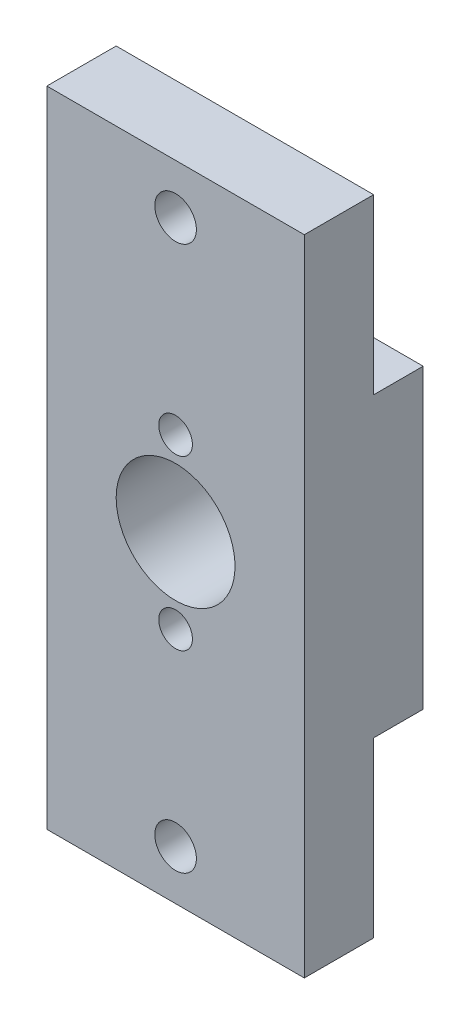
ISO-10303-21;
HEADER;
FILE_DESCRIPTION(('STEP AP214'),'2;1');
FILE_NAME('part.step','',(''),(''),'','','');
FILE_SCHEMA(('AUTOMOTIVE_DESIGN { 1 0 10303 214 1 1 1 1 }'));
ENDSEC;
DATA;
#1=APPLICATION_CONTEXT('core data for automotive mechanical design processes');
#2=APPLICATION_PROTOCOL_DEFINITION('international standard','automotive_design',2000,#1);
#3=PRODUCT_CONTEXT('',#1,'mechanical');
#4=PRODUCT('Part','Part','',(#3));
#5=PRODUCT_RELATED_PRODUCT_CATEGORY('part','',(#4));
#6=PRODUCT_DEFINITION_FORMATION('','',#4);
#7=PRODUCT_DEFINITION_CONTEXT('part definition',#1,'design');
#8=PRODUCT_DEFINITION('design','',#6,#7);
#9=PRODUCT_DEFINITION_SHAPE('','',#8);
#10=(LENGTH_UNIT() NAMED_UNIT(*) SI_UNIT(.MILLI.,.METRE.));
#11=(NAMED_UNIT(*) PLANE_ANGLE_UNIT() SI_UNIT($,.RADIAN.));
#12=(NAMED_UNIT(*) SI_UNIT($,.STERADIAN.) SOLID_ANGLE_UNIT());
#13=UNCERTAINTY_MEASURE_WITH_UNIT(LENGTH_MEASURE(1.E-05),#10,'distance_accuracy_value','');
#14=(GEOMETRIC_REPRESENTATION_CONTEXT(3) GLOBAL_UNCERTAINTY_ASSIGNED_CONTEXT((#13)) GLOBAL_UNIT_ASSIGNED_CONTEXT((#10,
#11,#12)) REPRESENTATION_CONTEXT('',''));
#15=CARTESIAN_POINT('',(0.,0.,0.));
#16=DIRECTION('',(0.,0.,1.));
#17=DIRECTION('',(1.,0.,0.));
#18=AXIS2_PLACEMENT_3D('',#15,#16,#17);
#19=CARTESIAN_POINT('',(-15.,15.,5.));
#20=DIRECTION('',(0.,-1.,0.));
#21=DIRECTION('',(0.,0.,-1.));
#22=AXIS2_PLACEMENT_3D('',#19,#20,#21);
#23=PLANE('',#22);
#24=DIRECTION('',(0.,0.,-1.));
#25=VECTOR('',#24,1.);
#26=CARTESIAN_POINT('',(-13.,15.,5.));
#27=LINE('',#26,#25);
#28=CARTESIAN_POINT('',(-13.,15.,5.));
#29=VERTEX_POINT('',#28);
#30=CARTESIAN_POINT('',(-13.,15.,0.));
#31=VERTEX_POINT('',#30);
#32=EDGE_CURVE('E123',#29,#31,#27,.T.);
#33=ORIENTED_EDGE('',*,*,#32,.F.);
#34=DIRECTION('',(-1.,0.,0.));
#35=VECTOR('',#34,1.);
#36=CARTESIAN_POINT('',(-15.,15.,5.));
#37=LINE('',#36,#35);
#38=CARTESIAN_POINT('',(13.,15.,5.));
#39=VERTEX_POINT('',#38);
#40=EDGE_CURVE('E148',#39,#29,#37,.T.);
#41=ORIENTED_EDGE('',*,*,#40,.F.);
#42=DIRECTION('',(0.,0.,1.));
#43=VECTOR('',#42,1.);
#44=CARTESIAN_POINT('',(13.,15.,0.));
#45=LINE('',#44,#43);
#46=CARTESIAN_POINT('',(13.,15.,0.));
#47=VERTEX_POINT('',#46);
#48=EDGE_CURVE('E145',#47,#39,#45,.T.);
#49=ORIENTED_EDGE('',*,*,#48,.F.);
#50=DIRECTION('',(-1.,0.,0.));
#51=VECTOR('',#50,1.);
#52=CARTESIAN_POINT('',(-15.,15.,0.));
#53=LINE('',#52,#51);
#54=EDGE_CURVE('E140',#47,#31,#53,.T.);
#55=ORIENTED_EDGE('',*,*,#54,.T.);
#56=EDGE_LOOP('',(#33,#41,#49,#55));
#57=FACE_BOUND('',#56,.T.);
#58=ADVANCED_FACE('F41',(#57),#23,.F.);
#59=CARTESIAN_POINT('',(-15.,-15.,5.));
#60=DIRECTION('',(0.,1.,0.));
#61=DIRECTION('',(0.,0.,1.));
#62=AXIS2_PLACEMENT_3D('',#59,#60,#61);
#63=PLANE('',#62);
#64=DIRECTION('',(0.,0.,1.));
#65=VECTOR('',#64,1.);
#66=CARTESIAN_POINT('',(-13.,-15.,0.));
#67=LINE('',#66,#65);
#68=CARTESIAN_POINT('',(-13.,-15.,0.));
#69=VERTEX_POINT('',#68);
#70=CARTESIAN_POINT('',(-13.,-15.,5.));
#71=VERTEX_POINT('',#70);
#72=EDGE_CURVE('E142',#69,#71,#67,.T.);
#73=ORIENTED_EDGE('',*,*,#72,.F.);
#74=DIRECTION('',(1.,0.,0.));
#75=VECTOR('',#74,1.);
#76=CARTESIAN_POINT('',(-15.,-15.,0.));
#77=LINE('',#76,#75);
#78=CARTESIAN_POINT('',(13.,-15.,0.));
#79=VERTEX_POINT('',#78);
#80=EDGE_CURVE('E141',#69,#79,#77,.T.);
#81=ORIENTED_EDGE('',*,*,#80,.T.);
#82=DIRECTION('',(0.,0.,-1.));
#83=VECTOR('',#82,1.);
#84=CARTESIAN_POINT('',(13.,-15.,5.));
#85=LINE('',#84,#83);
#86=CARTESIAN_POINT('',(13.,-15.,5.));
#87=VERTEX_POINT('',#86);
#88=EDGE_CURVE('E272',#87,#79,#85,.T.);
#89=ORIENTED_EDGE('',*,*,#88,.F.);
#90=DIRECTION('',(1.,0.,0.));
#91=VECTOR('',#90,1.);
#92=CARTESIAN_POINT('',(-15.,-15.,5.));
#93=LINE('',#92,#91);
#94=EDGE_CURVE('E154',#71,#87,#93,.T.);
#95=ORIENTED_EDGE('',*,*,#94,.F.);
#96=EDGE_LOOP('',(#73,#81,#89,#95));
#97=FACE_BOUND('',#96,.T.);
#98=ADVANCED_FACE('F183',(#97),#63,.F.);
#99=CARTESIAN_POINT('',(0.,0.,0.));
#100=DIRECTION('',(0.,0.,1.));
#101=DIRECTION('',(1.,0.,0.));
#102=AXIS2_PLACEMENT_3D('',#99,#100,#101);
#103=PLANE('',#102);
#104=CARTESIAN_POINT('',(0.,0.,0.));
#105=DIRECTION('',(0.,0.,-1.));
#106=DIRECTION('',(-1.,0.,0.));
#107=AXIS2_PLACEMENT_3D('',#104,#105,#106);
#108=CIRCLE('',#107,6.);
#109=CARTESIAN_POINT('',(1.78907720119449,5.72705882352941,0.));
#110=VERTEX_POINT('',#109);
#111=CARTESIAN_POINT('',(1.78907720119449,-5.72705882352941,0.));
#112=VERTEX_POINT('',#111);
#113=EDGE_CURVE('E259',#110,#112,#108,.T.);
#114=ORIENTED_EDGE('',*,*,#113,.F.);
#115=CARTESIAN_POINT('',(0.,8.5,0.));
#116=DIRECTION('',(0.,0.,-1.));
#117=DIRECTION('',(-1.,0.,0.));
#118=AXIS2_PLACEMENT_3D('',#115,#116,#117);
#119=CIRCLE('',#118,3.3);
#120=CARTESIAN_POINT('',(-1.78907720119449,5.72705882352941,0.));
#121=VERTEX_POINT('',#120);
#122=EDGE_CURVE('E248',#121,#110,#119,.T.);
#123=ORIENTED_EDGE('',*,*,#122,.F.);
#124=CARTESIAN_POINT('',(-1.78907720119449,-5.72705882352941,0.));
#125=VERTEX_POINT('',#124);
#126=EDGE_CURVE('E151',#125,#121,#108,.T.);
#127=ORIENTED_EDGE('',*,*,#126,.F.);
#128=CARTESIAN_POINT('',(0.,-8.5,0.));
#129=DIRECTION('',(0.,0.,-1.));
#130=DIRECTION('',(-1.,0.,0.));
#131=AXIS2_PLACEMENT_3D('',#128,#129,#130);
#132=CIRCLE('',#131,3.3);
#133=EDGE_CURVE('E254',#112,#125,#132,.T.);
#134=ORIENTED_EDGE('',*,*,#133,.F.);
#135=EDGE_LOOP('',(#114,#123,#127,#134));
#136=FACE_BOUND('',#135,.T.);
#137=DIRECTION('',(0.,-1.,0.));
#138=VECTOR('',#137,1.);
#139=CARTESIAN_POINT('',(-13.,15.,0.));
#140=LINE('',#139,#138);
#141=EDGE_CURVE('E126',#31,#69,#140,.T.);
#142=ORIENTED_EDGE('',*,*,#141,.F.);
#143=ORIENTED_EDGE('',*,*,#54,.F.);
#144=DIRECTION('',(0.,1.,0.));
#145=VECTOR('',#144,1.);
#146=CARTESIAN_POINT('',(13.,-15.,0.));
#147=LINE('',#146,#145);
#148=EDGE_CURVE('E274',#79,#47,#147,.T.);
#149=ORIENTED_EDGE('',*,*,#148,.F.);
#150=ORIENTED_EDGE('',*,*,#80,.F.);
#151=EDGE_LOOP('',(#142,#143,#149,#150));
#152=FACE_BOUND('',#151,.T.);
#153=ADVANCED_FACE('F138',(#136,#152),#103,.F.);
#154=CARTESIAN_POINT('',(0.,0.,5.));
#155=DIRECTION('',(0.,0.,-1.));
#156=DIRECTION('',(-1.,0.,0.));
#157=AXIS2_PLACEMENT_3D('',#154,#155,#156);
#158=PLANE('',#157);
#159=CARTESIAN_POINT('',(0.,27.5,5.));
#160=DIRECTION('',(0.,0.,-1.));
#161=DIRECTION('',(-1.,0.,0.));
#162=AXIS2_PLACEMENT_3D('',#159,#160,#161);
#163=CIRCLE('',#162,2.09999999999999);
#164=CARTESIAN_POINT('',(-2.09999999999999,27.5,5.));
#165=VERTEX_POINT('',#164);
#166=EDGE_CURVE('E288',#165,#165,#163,.T.);
#167=ORIENTED_EDGE('',*,*,#166,.F.);
#168=EDGE_LOOP('',(#167));
#169=FACE_BOUND('',#168,.T.);
#170=ORIENTED_EDGE('',*,*,#40,.T.);
#171=DIRECTION('',(0.,-1.,0.));
#172=VECTOR('',#171,1.);
#173=CARTESIAN_POINT('',(-13.,32.5,5.));
#174=LINE('',#173,#172);
#175=CARTESIAN_POINT('',(-13.,32.5,5.));
#176=VERTEX_POINT('',#175);
#177=EDGE_CURVE('E129',#176,#29,#174,.T.);
#178=ORIENTED_EDGE('',*,*,#177,.F.);
#179=DIRECTION('',(-1.,0.,0.));
#180=VECTOR('',#179,1.);
#181=CARTESIAN_POINT('',(15.,32.5,5.));
#182=LINE('',#181,#180);
#183=CARTESIAN_POINT('',(13.,32.5,5.));
#184=VERTEX_POINT('',#183);
#185=EDGE_CURVE('E238',#184,#176,#182,.T.);
#186=ORIENTED_EDGE('',*,*,#185,.F.);
#187=DIRECTION('',(0.,1.,0.));
#188=VECTOR('',#187,1.);
#189=CARTESIAN_POINT('',(13.,15.,5.));
#190=LINE('',#189,#188);
#191=EDGE_CURVE('E281',#39,#184,#190,.T.);
#192=ORIENTED_EDGE('',*,*,#191,.F.);
#193=EDGE_LOOP('',(#170,#178,#186,#192));
#194=FACE_BOUND('',#193,.T.);
#195=ADVANCED_FACE('F191',(#169,#194),#158,.T.);
#196=CARTESIAN_POINT('',(0.,0.,12.));
#197=DIRECTION('',(0.,0.,-1.));
#198=DIRECTION('',(-1.,0.,0.));
#199=AXIS2_PLACEMENT_3D('',#196,#197,#198);
#200=PLANE('',#199);
#201=CARTESIAN_POINT('',(0.,27.5,12.));
#202=DIRECTION('',(0.,0.,1.));
#203=DIRECTION('',(1.,0.,0.));
#204=AXIS2_PLACEMENT_3D('',#201,#202,#203);
#205=CIRCLE('',#204,2.09999999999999);
#206=CARTESIAN_POINT('',(2.09999999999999,27.5,12.));
#207=VERTEX_POINT('',#206);
#208=EDGE_CURVE('E209',#207,#207,#205,.T.);
#209=ORIENTED_EDGE('',*,*,#208,.F.);
#210=EDGE_LOOP('',(#209));
#211=FACE_BOUND('',#210,.T.);
#212=CARTESIAN_POINT('',(0.,-27.5,12.));
#213=DIRECTION('',(0.,0.,1.));
#214=DIRECTION('',(1.,0.,0.));
#215=AXIS2_PLACEMENT_3D('',#212,#213,#214);
#216=CIRCLE('',#215,2.09999999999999);
#217=CARTESIAN_POINT('',(2.09999999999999,-27.5,12.));
#218=VERTEX_POINT('',#217);
#219=EDGE_CURVE('E213',#218,#218,#216,.T.);
#220=ORIENTED_EDGE('',*,*,#219,.F.);
#221=EDGE_LOOP('',(#220));
#222=FACE_BOUND('',#221,.T.);
#223=CARTESIAN_POINT('',(0.,8.5,12.));
#224=DIRECTION('',(0.,0.,-1.));
#225=DIRECTION('',(-1.,0.,0.));
#226=AXIS2_PLACEMENT_3D('',#223,#224,#225);
#227=CIRCLE('',#226,1.7);
#228=CARTESIAN_POINT('',(-1.7,8.5,12.));
#229=VERTEX_POINT('',#228);
#230=EDGE_CURVE('E217',#229,#229,#227,.T.);
#231=ORIENTED_EDGE('',*,*,#230,.T.);
#232=EDGE_LOOP('',(#231));
#233=FACE_BOUND('',#232,.T.);
#234=CARTESIAN_POINT('',(0.,-8.5,12.));
#235=DIRECTION('',(0.,0.,-1.));
#236=DIRECTION('',(-1.,0.,0.));
#237=AXIS2_PLACEMENT_3D('',#234,#235,#236);
#238=CIRCLE('',#237,1.7);
#239=CARTESIAN_POINT('',(-1.7,-8.5,12.));
#240=VERTEX_POINT('',#239);
#241=EDGE_CURVE('E220',#240,#240,#238,.T.);
#242=ORIENTED_EDGE('',*,*,#241,.T.);
#243=EDGE_LOOP('',(#242));
#244=FACE_BOUND('',#243,.T.);
#245=CARTESIAN_POINT('',(0.,0.,12.));
#246=DIRECTION('',(0.,0.,-1.));
#247=DIRECTION('',(-1.,0.,0.));
#248=AXIS2_PLACEMENT_3D('',#245,#246,#247);
#249=CIRCLE('',#248,6.);
#250=CARTESIAN_POINT('',(-6.,0.,12.));
#251=VERTEX_POINT('',#250);
#252=EDGE_CURVE('E146',#251,#251,#249,.T.);
#253=ORIENTED_EDGE('',*,*,#252,.T.);
#254=EDGE_LOOP('',(#253));
#255=FACE_BOUND('',#254,.T.);
#256=DIRECTION('',(0.,1.,0.));
#257=VECTOR('',#256,1.);
#258=CARTESIAN_POINT('',(-13.,-32.5,12.));
#259=LINE('',#258,#257);
#260=CARTESIAN_POINT('',(-13.,-32.5,12.));
#261=VERTEX_POINT('',#260);
#262=CARTESIAN_POINT('',(-13.,32.5,12.));
#263=VERTEX_POINT('',#262);
#264=EDGE_CURVE('E226',#261,#263,#259,.T.);
#265=ORIENTED_EDGE('',*,*,#264,.F.);
#266=DIRECTION('',(-1.,0.,0.));
#267=VECTOR('',#266,1.);
#268=CARTESIAN_POINT('',(15.,-32.5,12.));
#269=LINE('',#268,#267);
#270=CARTESIAN_POINT('',(13.,-32.5,12.));
#271=VERTEX_POINT('',#270);
#272=EDGE_CURVE('E228',#271,#261,#269,.T.);
#273=ORIENTED_EDGE('',*,*,#272,.F.);
#274=DIRECTION('',(0.,-1.,0.));
#275=VECTOR('',#274,1.);
#276=CARTESIAN_POINT('',(13.,32.5,12.));
#277=LINE('',#276,#275);
#278=CARTESIAN_POINT('',(13.,32.5,12.));
#279=VERTEX_POINT('',#278);
#280=EDGE_CURVE('E69',#279,#271,#277,.T.);
#281=ORIENTED_EDGE('',*,*,#280,.F.);
#282=DIRECTION('',(1.,0.,0.));
#283=VECTOR('',#282,1.);
#284=CARTESIAN_POINT('',(-15.,32.5,12.));
#285=LINE('',#284,#283);
#286=EDGE_CURVE('E229',#263,#279,#285,.T.);
#287=ORIENTED_EDGE('',*,*,#286,.F.);
#288=EDGE_LOOP('',(#265,#273,#281,#287));
#289=FACE_BOUND('',#288,.T.);
#290=ADVANCED_FACE('F196',(#211,#222,#233,#244,#255,#289),#200,.F.);
#291=CARTESIAN_POINT('',(0.,-27.5,5.));
#292=DIRECTION('',(0.,0.,-1.));
#293=DIRECTION('',(-1.,0.,0.));
#294=AXIS2_PLACEMENT_3D('',#291,#292,#293);
#295=CIRCLE('',#294,2.09999999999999);
#296=CARTESIAN_POINT('',(-2.09999999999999,-27.5,5.));
#297=VERTEX_POINT('',#296);
#298=EDGE_CURVE('E243',#297,#297,#295,.T.);
#299=ORIENTED_EDGE('',*,*,#298,.F.);
#300=EDGE_LOOP('',(#299));
#301=FACE_BOUND('',#300,.T.);
#302=DIRECTION('',(1.,0.,0.));
#303=VECTOR('',#302,1.);
#304=CARTESIAN_POINT('',(-15.,-32.5,5.));
#305=LINE('',#304,#303);
#306=CARTESIAN_POINT('',(-13.,-32.5,5.));
#307=VERTEX_POINT('',#306);
#308=CARTESIAN_POINT('',(13.,-32.5,5.));
#309=VERTEX_POINT('',#308);
#310=EDGE_CURVE('E239',#307,#309,#305,.T.);
#311=ORIENTED_EDGE('',*,*,#310,.F.);
#312=DIRECTION('',(0.,-1.,0.));
#313=VECTOR('',#312,1.);
#314=CARTESIAN_POINT('',(-13.,-15.,5.));
#315=LINE('',#314,#313);
#316=EDGE_CURVE('E61',#71,#307,#315,.T.);
#317=ORIENTED_EDGE('',*,*,#316,.F.);
#318=ORIENTED_EDGE('',*,*,#94,.T.);
#319=DIRECTION('',(0.,1.,0.));
#320=VECTOR('',#319,1.);
#321=CARTESIAN_POINT('',(13.,-32.5,5.));
#322=LINE('',#321,#320);
#323=EDGE_CURVE('E268',#309,#87,#322,.T.);
#324=ORIENTED_EDGE('',*,*,#323,.F.);
#325=EDGE_LOOP('',(#311,#317,#318,#324));
#326=FACE_BOUND('',#325,.T.);
#327=ADVANCED_FACE('F198',(#301,#326),#158,.T.);
#328=CARTESIAN_POINT('',(0.,32.5,0.));
#329=DIRECTION('',(0.,1.,0.));
#330=DIRECTION('',(0.,0.,1.));
#331=AXIS2_PLACEMENT_3D('',#328,#329,#330);
#332=PLANE('',#331);
#333=ORIENTED_EDGE('',*,*,#185,.T.);
#334=DIRECTION('',(0.,0.,-1.));
#335=VECTOR('',#334,1.);
#336=CARTESIAN_POINT('',(-13.,32.5,12.));
#337=LINE('',#336,#335);
#338=EDGE_CURVE('E231',#263,#176,#337,.T.);
#339=ORIENTED_EDGE('',*,*,#338,.F.);
#340=ORIENTED_EDGE('',*,*,#286,.T.);
#341=DIRECTION('',(0.,0.,1.));
#342=VECTOR('',#341,1.);
#343=CARTESIAN_POINT('',(13.,32.5,5.));
#344=LINE('',#343,#342);
#345=EDGE_CURVE('E283',#184,#279,#344,.T.);
#346=ORIENTED_EDGE('',*,*,#345,.F.);
#347=EDGE_LOOP('',(#333,#339,#340,#346));
#348=FACE_BOUND('',#347,.T.);
#349=ADVANCED_FACE('F204',(#348),#332,.T.);
#350=CARTESIAN_POINT('',(0.,-32.5,0.));
#351=DIRECTION('',(0.,-1.,0.));
#352=DIRECTION('',(0.,0.,-1.));
#353=AXIS2_PLACEMENT_3D('',#350,#351,#352);
#354=PLANE('',#353);
#355=ORIENTED_EDGE('',*,*,#272,.T.);
#356=DIRECTION('',(0.,0.,1.));
#357=VECTOR('',#356,1.);
#358=CARTESIAN_POINT('',(-13.,-32.5,5.));
#359=LINE('',#358,#357);
#360=EDGE_CURVE('E232',#307,#261,#359,.T.);
#361=ORIENTED_EDGE('',*,*,#360,.F.);
#362=ORIENTED_EDGE('',*,*,#310,.T.);
#363=DIRECTION('',(0.,0.,-1.));
#364=VECTOR('',#363,1.);
#365=CARTESIAN_POINT('',(13.,-32.5,12.));
#366=LINE('',#365,#364);
#367=EDGE_CURVE('E237',#271,#309,#366,.T.);
#368=ORIENTED_EDGE('',*,*,#367,.F.);
#369=EDGE_LOOP('',(#355,#361,#362,#368));
#370=FACE_BOUND('',#369,.T.);
#371=ADVANCED_FACE('F235',(#370),#354,.T.);
#372=CARTESIAN_POINT('',(0.,0.,12.));
#373=DIRECTION('',(0.,0.,-1.));
#374=DIRECTION('',(-1.,0.,0.));
#375=AXIS2_PLACEMENT_3D('',#372,#373,#374);
#376=CYLINDRICAL_SURFACE('',#375,6.);
#377=ORIENTED_EDGE('',*,*,#252,.F.);
#378=EDGE_LOOP('',(#377));
#379=FACE_BOUND('',#378,.T.);
#380=ORIENTED_EDGE('',*,*,#126,.T.);
#381=CARTESIAN_POINT('',(-1.78932574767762,5.72698117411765,-0.000200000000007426));
#382=CARTESIAN_POINT('',(-1.71654886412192,5.74970306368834,0.0582883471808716));
#383=CARTESIAN_POINT('',(-1.64244035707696,5.77135027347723,0.115632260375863));
#384=CARTESIAN_POINT('',(-1.49075599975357,5.81239183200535,0.227150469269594));
#385=CARTESIAN_POINT('',(-1.41316626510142,5.83177579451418,0.281309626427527));
#386=CARTESIAN_POINT('',(-1.25208760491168,5.86849883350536,0.386518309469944));
#387=CARTESIAN_POINT('',(-1.16849357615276,5.88576388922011,0.437435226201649));
#388=CARTESIAN_POINT('',(-0.997097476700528,5.91721096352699,0.532391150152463));
#389=CARTESIAN_POINT('',(-0.909303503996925,5.93139864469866,0.576442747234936));
#390=CARTESIAN_POINT('',(-0.721430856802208,5.95728324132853,0.658407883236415));
#391=CARTESIAN_POINT('',(-0.620937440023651,5.96867552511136,0.695508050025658));
#392=CARTESIAN_POINT('',(-0.466994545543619,5.98201885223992,0.739551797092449));
#393=CARTESIAN_POINT('',(-0.415340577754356,5.98583525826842,0.752273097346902));
#394=CARTESIAN_POINT('',(-0.311097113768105,5.99215657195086,0.773450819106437));
#395=CARTESIAN_POINT('',(-0.258508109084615,5.99466214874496,0.781909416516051));
#396=CARTESIAN_POINT('',(-0.152075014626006,5.99831170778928,0.794258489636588));
#397=CARTESIAN_POINT('',(-0.0982234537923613,5.99943826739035,0.798090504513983));
#398=CARTESIAN_POINT('',(0.00961437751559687,6.00023457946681,0.800797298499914));
#399=CARTESIAN_POINT('',(0.063600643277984,5.99990438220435,0.799672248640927));
#400=CARTESIAN_POINT('',(0.171310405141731,5.99779609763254,0.792515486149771));
#401=CARTESIAN_POINT('',(0.225033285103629,5.99601550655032,0.786475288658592));
#402=CARTESIAN_POINT('',(0.331701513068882,5.9910628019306,0.769782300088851));
#403=CARTESIAN_POINT('',(0.384646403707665,5.98788990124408,0.759126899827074));
#404=CARTESIAN_POINT('',(0.567579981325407,5.97452410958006,0.714638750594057));
#405=CARTESIAN_POINT('',(0.694762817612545,5.96091734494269,0.669933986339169));
#406=CARTESIAN_POINT('',(0.879016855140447,5.9355913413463,0.58971007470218));
#407=CARTESIAN_POINT('',(0.939540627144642,5.92629036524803,0.560654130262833));
#408=CARTESIAN_POINT('',(1.05850983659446,5.90619856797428,0.499005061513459));
#409=CARTESIAN_POINT('',(1.11695595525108,5.89540824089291,0.466413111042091));
#410=CARTESIAN_POINT('',(1.22920282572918,5.87300482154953,0.400005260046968));
#411=CARTESIAN_POINT('',(1.28309306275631,5.86145365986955,0.366317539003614));
#412=CARTESIAN_POINT('',(1.3892608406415,5.83720116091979,0.296870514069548));
#413=CARTESIAN_POINT('',(1.44153820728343,5.82449969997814,0.261110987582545));
#414=CARTESIAN_POINT('',(1.54381245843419,5.79822295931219,0.188488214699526));
#415=CARTESIAN_POINT('',(1.59383220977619,5.78466442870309,0.151650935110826));
#416=CARTESIAN_POINT('',(1.69253909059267,5.75655577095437,0.0766528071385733));
#417=CARTESIAN_POINT('',(1.74122696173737,5.7420062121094,0.0384927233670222));
#418=CARTESIAN_POINT('',(1.78932574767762,5.72698117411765,-0.000200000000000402));
#419=B_SPLINE_CURVE_WITH_KNOTS('',3,(#381,#382,#383,#384,#385,#386,#387,#388,#389,#390,#391,
#392,#393,#394,#395,#396,#397,#398,#399,#400,#401,#402,#403,#404,#405,#406,#407,#408,#409,#410,
#411,#412,#413,#414,#415,#416,#417,#418),.UNSPECIFIED.,.F.,.F.,(4,2,2,2,2,2,2,2,2,2,2,2,2,2,2,2,
2,2,4),(0.,0.288338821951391,0.577952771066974,0.875820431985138,1.17313525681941,
1.4951369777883,1.65497622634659,1.81473380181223,1.97648960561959,2.13823982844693,
2.30026986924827,2.46239163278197,2.86619155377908,3.06946364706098,3.27266846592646,
3.4663864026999,3.66012519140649,3.85083761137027,4.04144157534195),.UNSPECIFIED.);
#420=EDGE_CURVE('E11',#121,#110,#419,.T.);
#421=ORIENTED_EDGE('',*,*,#420,.T.);
#422=ORIENTED_EDGE('',*,*,#113,.T.);
#423=CARTESIAN_POINT('',(1.78932574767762,-5.72698117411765,-0.000200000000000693));
#424=CARTESIAN_POINT('',(1.71654886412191,-5.74970306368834,0.0582883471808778));
#425=CARTESIAN_POINT('',(1.64244035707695,-5.77135027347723,0.115632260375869));
#426=CARTESIAN_POINT('',(1.49075599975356,-5.81239183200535,0.227150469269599));
#427=CARTESIAN_POINT('',(1.41316626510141,-5.83177579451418,0.281309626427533));
#428=CARTESIAN_POINT('',(1.25208760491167,-5.86849883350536,0.386518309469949));
#429=CARTESIAN_POINT('',(1.16849357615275,-5.88576388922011,0.437435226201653));
#430=CARTESIAN_POINT('',(0.99709747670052,-5.91721096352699,0.532391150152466));
#431=CARTESIAN_POINT('',(0.909303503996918,-5.93139864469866,0.576442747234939));
#432=CARTESIAN_POINT('',(0.721430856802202,-5.95728324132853,0.658407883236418));
#433=CARTESIAN_POINT('',(0.620937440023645,-5.96867552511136,0.695508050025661));
#434=CARTESIAN_POINT('',(0.466994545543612,-5.98201885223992,0.739551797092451));
#435=CARTESIAN_POINT('',(0.41534057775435,-5.98583525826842,0.752273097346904));
#436=CARTESIAN_POINT('',(0.311097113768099,-5.99215657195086,0.773450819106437));
#437=CARTESIAN_POINT('',(0.258508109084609,-5.99466214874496,0.781909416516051));
#438=CARTESIAN_POINT('',(0.152075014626,-5.99831170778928,0.794258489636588));
#439=CARTESIAN_POINT('',(0.0982234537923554,-5.99943826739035,0.798090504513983));
#440=CARTESIAN_POINT('',(-0.00961437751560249,-6.00023457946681,0.800797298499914));
#441=CARTESIAN_POINT('',(-0.0636006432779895,-5.99990438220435,0.799672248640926));
#442=CARTESIAN_POINT('',(-0.171310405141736,-5.99779609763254,0.792515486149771));
#443=CARTESIAN_POINT('',(-0.225033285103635,-5.99601550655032,0.786475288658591));
#444=CARTESIAN_POINT('',(-0.331701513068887,-5.9910628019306,0.76978230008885));
#445=CARTESIAN_POINT('',(-0.384646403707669,-5.98788990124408,0.759126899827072));
#446=CARTESIAN_POINT('',(-0.567579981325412,-5.97452410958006,0.714638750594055));
#447=CARTESIAN_POINT('',(-0.694762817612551,-5.96091734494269,0.669933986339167));
#448=CARTESIAN_POINT('',(-0.879016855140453,-5.9355913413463,0.589710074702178));
#449=CARTESIAN_POINT('',(-0.939540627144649,-5.92629036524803,0.56065413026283));
#450=CARTESIAN_POINT('',(-1.05850983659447,-5.90619856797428,0.499005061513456));
#451=CARTESIAN_POINT('',(-1.11695595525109,-5.89540824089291,0.466413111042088));
#452=CARTESIAN_POINT('',(-1.22920282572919,-5.87300482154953,0.400005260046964));
#453=CARTESIAN_POINT('',(-1.28309306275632,-5.86145365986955,0.366317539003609));
#454=CARTESIAN_POINT('',(-1.38926084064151,-5.83720116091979,0.296870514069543));
#455=CARTESIAN_POINT('',(-1.44153820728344,-5.82449969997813,0.26111098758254));
#456=CARTESIAN_POINT('',(-1.5438124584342,-5.79822295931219,0.18848821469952));
#457=CARTESIAN_POINT('',(-1.5938322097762,-5.78466442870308,0.15165093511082));
#458=CARTESIAN_POINT('',(-1.69253909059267,-5.75655577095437,0.0766528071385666));
#459=CARTESIAN_POINT('',(-1.74122696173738,-5.7420062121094,0.0384927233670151));
#460=CARTESIAN_POINT('',(-1.78932574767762,-5.72698117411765,-0.000200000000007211));
#461=B_SPLINE_CURVE_WITH_KNOTS('',3,(#423,#424,#425,#426,#427,#428,#429,#430,#431,#432,#433,
#434,#435,#436,#437,#438,#439,#440,#441,#442,#443,#444,#445,#446,#447,#448,#449,#450,#451,#452,
#453,#454,#455,#456,#457,#458,#459,#460),.UNSPECIFIED.,.F.,.F.,(4,2,2,2,2,2,2,2,2,2,2,2,2,2,2,2,
2,2,4),(0.,0.28833882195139,0.577952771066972,0.875820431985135,1.17313525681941,
1.4951369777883,1.65497622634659,1.81473380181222,1.97648960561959,2.13823982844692,
2.30026986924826,2.46239163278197,2.86619155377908,3.06946364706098,3.27266846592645,
3.4663864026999,3.66012519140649,3.85083761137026,4.04144157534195),.UNSPECIFIED.);
#462=EDGE_CURVE('E54',#112,#125,#461,.T.);
#463=ORIENTED_EDGE('',*,*,#462,.T.);
#464=EDGE_LOOP('',(#380,#421,#422,#463));
#465=FACE_BOUND('',#464,.T.);
#466=ADVANCED_FACE('F162',(#379,#465),#376,.F.);
#467=CARTESIAN_POINT('',(0.,-8.5,0.));
#468=DIRECTION('',(0.,0.,-1.));
#469=DIRECTION('',(-1.,0.,0.));
#470=AXIS2_PLACEMENT_3D('',#467,#468,#469);
#471=CONICAL_SURFACE('',#470,3.3,0.785398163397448);
#472=CARTESIAN_POINT('',(0.,-8.5,1.6));
#473=DIRECTION('',(0.,0.,-1.));
#474=DIRECTION('',(-1.,0.,0.));
#475=AXIS2_PLACEMENT_3D('',#472,#473,#474);
#476=CIRCLE('',#475,1.7);
#477=CARTESIAN_POINT('',(-1.7,-8.5,1.6));
#478=VERTEX_POINT('',#477);
#479=EDGE_CURVE('E256',#478,#478,#476,.T.);
#480=ORIENTED_EDGE('',*,*,#479,.F.);
#481=EDGE_LOOP('',(#480));
#482=FACE_BOUND('',#481,.T.);
#483=ORIENTED_EDGE('',*,*,#133,.T.);
#484=ORIENTED_EDGE('',*,*,#462,.F.);
#485=EDGE_LOOP('',(#483,#484));
#486=FACE_BOUND('',#485,.T.);
#487=ADVANCED_FACE('F166',(#482,#486),#471,.F.);
#488=CARTESIAN_POINT('',(0.,-8.5,0.));
#489=DIRECTION('',(0.,0.,-1.));
#490=DIRECTION('',(-1.,0.,0.));
#491=AXIS2_PLACEMENT_3D('',#488,#489,#490);
#492=CYLINDRICAL_SURFACE('',#491,1.7);
#493=ORIENTED_EDGE('',*,*,#241,.F.);
#494=EDGE_LOOP('',(#493));
#495=FACE_BOUND('',#494,.T.);
#496=ORIENTED_EDGE('',*,*,#479,.T.);
#497=EDGE_LOOP('',(#496));
#498=FACE_BOUND('',#497,.T.);
#499=ADVANCED_FACE('F170',(#495,#498),#492,.F.);
#500=CARTESIAN_POINT('',(0.,8.5,0.));
#501=DIRECTION('',(0.,0.,-1.));
#502=DIRECTION('',(-1.,0.,0.));
#503=AXIS2_PLACEMENT_3D('',#500,#501,#502);
#504=CONICAL_SURFACE('',#503,3.3,0.785398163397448);
#505=CARTESIAN_POINT('',(0.,8.5,1.6));
#506=DIRECTION('',(0.,0.,-1.));
#507=DIRECTION('',(-1.,0.,0.));
#508=AXIS2_PLACEMENT_3D('',#505,#506,#507);
#509=CIRCLE('',#508,1.7);
#510=CARTESIAN_POINT('',(-1.7,8.5,1.6));
#511=VERTEX_POINT('',#510);
#512=EDGE_CURVE('E250',#511,#511,#509,.T.);
#513=ORIENTED_EDGE('',*,*,#512,.F.);
#514=EDGE_LOOP('',(#513));
#515=FACE_BOUND('',#514,.T.);
#516=ORIENTED_EDGE('',*,*,#122,.T.);
#517=ORIENTED_EDGE('',*,*,#420,.F.);
#518=EDGE_LOOP('',(#516,#517));
#519=FACE_BOUND('',#518,.T.);
#520=ADVANCED_FACE('F174',(#515,#519),#504,.F.);
#521=CARTESIAN_POINT('',(0.,8.5,0.));
#522=DIRECTION('',(0.,0.,-1.));
#523=DIRECTION('',(-1.,0.,0.));
#524=AXIS2_PLACEMENT_3D('',#521,#522,#523);
#525=CYLINDRICAL_SURFACE('',#524,1.7);
#526=ORIENTED_EDGE('',*,*,#230,.F.);
#527=EDGE_LOOP('',(#526));
#528=FACE_BOUND('',#527,.T.);
#529=ORIENTED_EDGE('',*,*,#512,.T.);
#530=EDGE_LOOP('',(#529));
#531=FACE_BOUND('',#530,.T.);
#532=ADVANCED_FACE('F172',(#528,#531),#525,.F.);
#533=CARTESIAN_POINT('',(0.,-27.5,12.));
#534=DIRECTION('',(0.,0.,1.));
#535=DIRECTION('',(1.,0.,0.));
#536=AXIS2_PLACEMENT_3D('',#533,#534,#535);
#537=CYLINDRICAL_SURFACE('',#536,2.09999999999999);
#538=ORIENTED_EDGE('',*,*,#298,.T.);
#539=EDGE_LOOP('',(#538));
#540=FACE_BOUND('',#539,.T.);
#541=ORIENTED_EDGE('',*,*,#219,.T.);
#542=EDGE_LOOP('',(#541));
#543=FACE_BOUND('',#542,.T.);
#544=ADVANCED_FACE('F294',(#540,#543),#537,.F.);
#545=CARTESIAN_POINT('',(0.,27.5,12.));
#546=DIRECTION('',(0.,0.,1.));
#547=DIRECTION('',(1.,0.,0.));
#548=AXIS2_PLACEMENT_3D('',#545,#546,#547);
#549=CYLINDRICAL_SURFACE('',#548,2.09999999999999);
#550=ORIENTED_EDGE('',*,*,#166,.T.);
#551=EDGE_LOOP('',(#550));
#552=FACE_BOUND('',#551,.T.);
#553=ORIENTED_EDGE('',*,*,#208,.T.);
#554=EDGE_LOOP('',(#553));
#555=FACE_BOUND('',#554,.T.);
#556=ADVANCED_FACE('F297',(#552,#555),#549,.F.);
#557=CARTESIAN_POINT('',(13.,0.,0.));
#558=DIRECTION('',(1.,0.,0.));
#559=DIRECTION('',(0.,1.,0.));
#560=AXIS2_PLACEMENT_3D('',#557,#558,#559);
#561=PLANE('',#560);
#562=ORIENTED_EDGE('',*,*,#88,.T.);
#563=ORIENTED_EDGE('',*,*,#148,.T.);
#564=ORIENTED_EDGE('',*,*,#48,.T.);
#565=ORIENTED_EDGE('',*,*,#191,.T.);
#566=ORIENTED_EDGE('',*,*,#345,.T.);
#567=ORIENTED_EDGE('',*,*,#280,.T.);
#568=ORIENTED_EDGE('',*,*,#367,.T.);
#569=ORIENTED_EDGE('',*,*,#323,.T.);
#570=EDGE_LOOP('',(#562,#563,#564,#565,#566,#567,#568,#569));
#571=FACE_BOUND('',#570,.T.);
#572=ADVANCED_FACE('F271',(#571),#561,.T.);
#573=CARTESIAN_POINT('',(-13.,0.,0.));
#574=DIRECTION('',(-1.,0.,0.));
#575=DIRECTION('',(0.,-1.,0.));
#576=AXIS2_PLACEMENT_3D('',#573,#574,#575);
#577=PLANE('',#576);
#578=ORIENTED_EDGE('',*,*,#32,.T.);
#579=ORIENTED_EDGE('',*,*,#141,.T.);
#580=ORIENTED_EDGE('',*,*,#72,.T.);
#581=ORIENTED_EDGE('',*,*,#316,.T.);
#582=ORIENTED_EDGE('',*,*,#360,.T.);
#583=ORIENTED_EDGE('',*,*,#264,.T.);
#584=ORIENTED_EDGE('',*,*,#338,.T.);
#585=ORIENTED_EDGE('',*,*,#177,.T.);
#586=EDGE_LOOP('',(#578,#579,#580,#581,#582,#583,#584,#585));
#587=FACE_BOUND('',#586,.T.);
#588=ADVANCED_FACE('F125',(#587),#577,.T.);
#589=CLOSED_SHELL('',(#58,#98,#153,#195,#290,#327,#349,#371,#466,#487,#499,#520,#532,#544,#556,
#572,#588));
#590=MANIFOLD_SOLID_BREP('B2',#589);
#591=ADVANCED_BREP_SHAPE_REPRESENTATION('',(#18,#590),#14);
#592=SHAPE_DEFINITION_REPRESENTATION(#9,#591);
ENDSEC;
END-ISO-10303-21;
